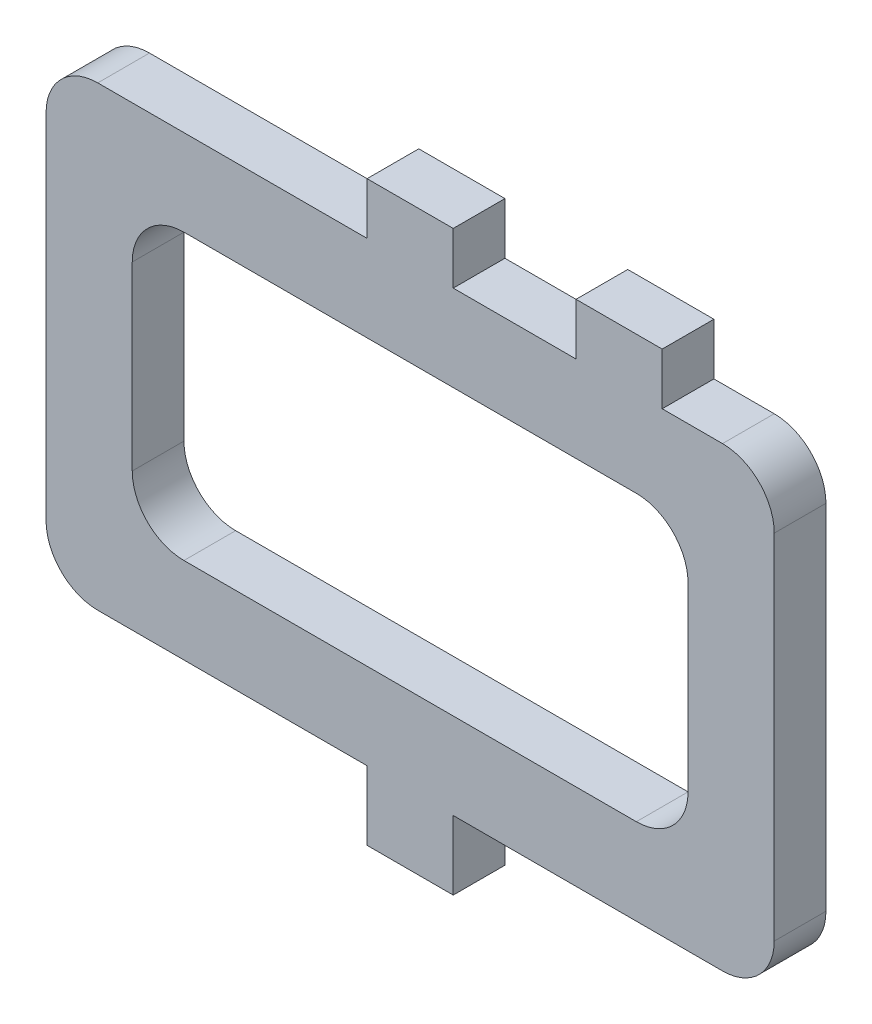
from build123d import *

# Parameters (mm, degrees)
SALIENTE_EXTRUIR1_DEPTH = 3
CORTAR_EXTRUIR1_DEPTH   = 4


with BuildPart() as part:
    # Croquis1 → Saliente-Extruir1 (new body)
    with BuildSketch(Plane.XY):
        with BuildLine():
            Line((-102.615102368, -90.721952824), (-86.990102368, -90.721952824))
            ThreePointArc((-86.990102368, -90.721952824), (-84.868782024, -89.843273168), (-83.990102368, -87.721952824))
            Line((-83.990102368, -87.721952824), (-83.990102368, -67.221952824))
            ThreePointArc((-83.990102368, -67.221952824), (-84.868782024, -65.10063248), (-86.990102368, -64.221952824))
            Line((-86.990102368, -64.221952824), (-90.490102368, -64.221952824))
            Line((-90.490102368, -64.221952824), (-90.490102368, -61.221952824))
            Line((-90.490102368, -61.221952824), (-95.490102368, -61.221952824))
            Line((-95.490102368, -61.221952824), (-95.490102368, -64.221952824))
            Line((-95.490102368, -64.221952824), (-102.615102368, -64.221952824))
            Line((-102.615102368, -64.221952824), (-102.615102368, -61.221952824))
            Line((-102.615102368, -61.221952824), (-105.115102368, -61.221952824))
            Line((-105.115102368, -61.221952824), (-107.615102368, -61.221952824))
            Line((-107.615102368, -61.221952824), (-107.615102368, -64.221952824))
            Line((-107.615102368, -64.221952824), (-123.240102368, -64.221952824))
            ThreePointArc((-123.240102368, -64.221952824), (-125.361422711, -65.10063248), (-126.240102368, -67.221952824))
            Line((-126.240102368, -67.221952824), (-126.240102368, -87.721952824))
            ThreePointArc((-126.240102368, -87.721952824), (-125.361422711, -89.843273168), (-123.240102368, -90.721952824))
            Line((-123.240102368, -90.721952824), (-107.615102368, -90.721952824))
            Line((-107.615102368, -90.721952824), (-107.615102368, -94.721952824))
            Line((-107.615102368, -94.721952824), (-105.115102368, -94.721952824))
            Line((-105.115102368, -94.721952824), (-102.615102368, -94.721952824))
            Line((-102.615102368, -94.721952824), (-102.615102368, -90.721952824))
        make_face()
    extrude(amount=SALIENTE_EXTRUIR1_DEPTH)

    # Croquis2 → Cortar-Extruir1 (cut)
    with BuildSketch(Plane.XY.offset(3)):
        with BuildLine():
            Line((-115.427602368, -69.221952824), (-91.990102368, -69.221952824))
            ThreePointArc((-91.990102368, -69.221952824), (-89.868782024, -70.10063248), (-88.990102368, -72.221952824))
            Line((-88.990102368, -72.221952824), (-88.990102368, -82.721952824))
            ThreePointArc((-88.990102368, -82.721952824), (-89.868782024, -84.843273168), (-91.990102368, -85.721952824))
            Line((-91.990102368, -85.721952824), (-118.240102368, -85.721952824))
            ThreePointArc((-118.240102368, -85.721952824), (-120.361422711, -84.843273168), (-121.240102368, -82.721952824))
            Line((-121.240102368, -82.721952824), (-121.240102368, -72.221952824))
            ThreePointArc((-121.240102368, -72.221952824), (-120.361422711, -70.10063248), (-118.240102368, -69.221952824))
            Line((-118.240102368, -69.221952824), (-115.427602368, -69.221952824))
        make_face()
    extrude(amount=-CORTAR_EXTRUIR1_DEPTH, mode=Mode.SUBTRACT)


solid = part.part
